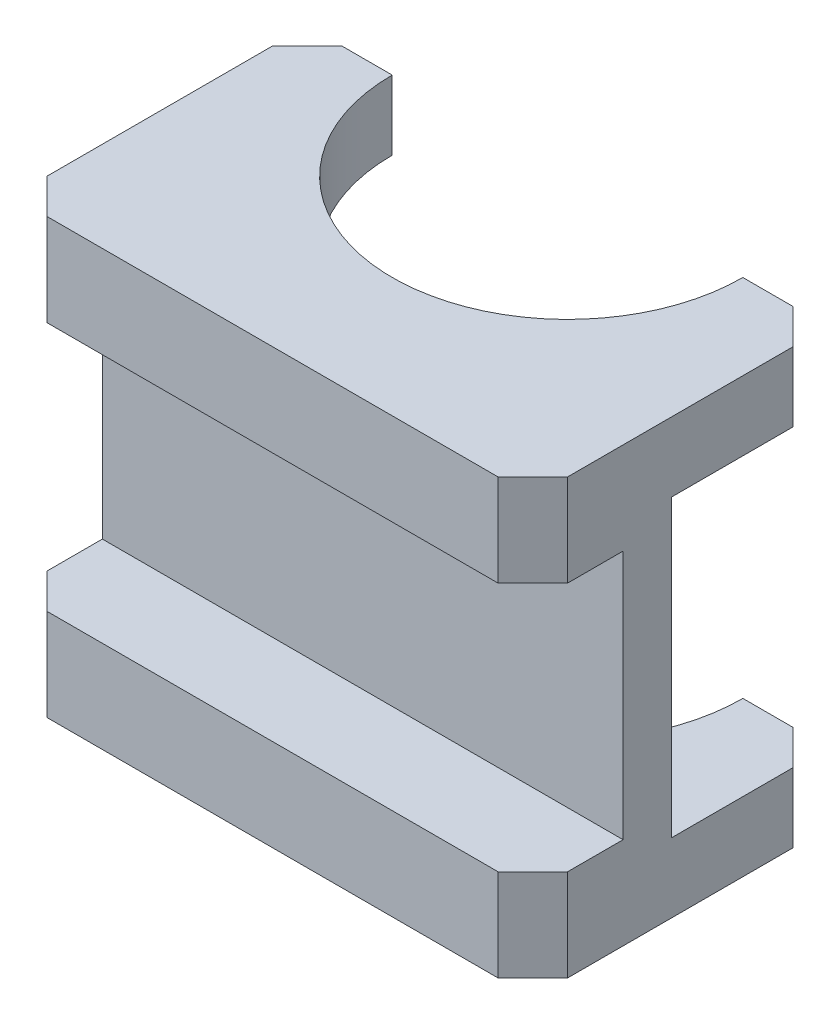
from build123d import *

# Parameters (mm, degrees)
EXTRUDE1_DEPTH     = 31.75
SKETCH2_W          = 6.604
SKETCH2_H          = 18.288
SKETCH2_W_2        = 11.455561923
SKETCH2_H_2        = 21.59
CUT_EXTRUDE1_DEPTH = 55.090670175
CHAMFER1_SIZE      = 2.54


with BuildPart() as part:
    # Sketch1 → Extrude1 (new body)
    with BuildSketch(Plane(origin=(0, 0, 0), x_dir=(1, 0, 0), z_dir=(0, 1, 0))):
        with BuildLine():
            Line((0, 0), (38.1, 0))
            Line((38.1, 0), (38.1, 21.59))
            Line((38.1, 21.59), (31.877, 21.59))
            ThreePointArc((31.877, 21.59), (19.05, 8.763), (6.223, 21.59))
            Line((6.223, 21.59), (0, 21.59))
            Line((0, 21.59), (0, 0))
        make_face()
    extrude(amount=EXTRUDE1_DEPTH)

    # Sketch2 → Cut-Extrude1 (cut, through all)
    with BuildSketch(Plane(origin=(38.1, 0, 0), x_dir=(0, 0, -1), z_dir=(1, 0, 0))):
        with Locations((3.302, 15.875)):
            Rectangle(SKETCH2_W, SKETCH2_H)
        with Locations((15.862219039, 15.875)):
            Rectangle(SKETCH2_W_2, SKETCH2_H_2)
    extrude(amount=-CUT_EXTRUDE1_DEPTH, mode=Mode.SUBTRACT)

    # Chamfer1
    chamfer1_edges = [part.edges().sort_by_distance(p)[0] for p in [
        (38.1, 29.21, -21.59),
        (38.1, 28.3845, 0),
        (0, 28.3845, 0),
        (38.1, 3.3655, 0),
        (0, 3.3655, 0),
        (0, 2.54, -21.59),
        (38.1, 2.54, -21.59),
        (0, 29.21, -21.59),
    ]]
    chamfer(chamfer1_edges, length=CHAMFER1_SIZE)


solid = part.part
